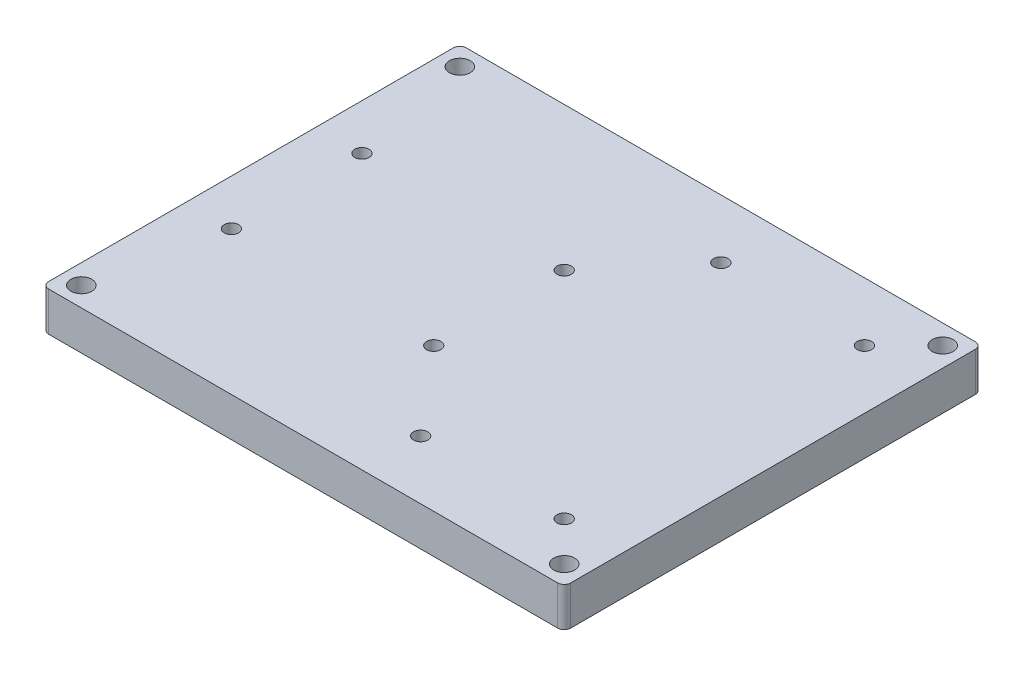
from build123d import *

# Parameters (mm, degrees)
ESQUISSE1_R        = 1.1
ESQUISSE1_R_2      = 1.6
BOSS_EXTRU_1_DEPTH = 6


with BuildPart() as part:
    # Esquisse1 → Boss.-Extru.1 (new body)
    with BuildSketch(Plane(origin=(0, 0, 0), x_dir=(1, 0, 0), z_dir=(0, 1, 0))):
        with BuildLine():
            Line((1, 0), (79, 0))
            ThreePointArc((79, 0), (79.707106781, 0.292893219), (80, 1))
            Line((80, 1), (80, 63))
            ThreePointArc((80, 63), (79.707106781, 63.707106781), (79, 64))
            Line((79, 64), (1, 64))
            ThreePointArc((1, 64), (0.292893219, 63.707106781), (0, 63))
            Line((0, 63), (0, 1))
            ThreePointArc((0, 1), (0.292893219, 0.292893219), (1, 0))
        make_face()
        with Locations(Location((71, 9, 0), (0, 0, 270))):
            Circle(ESQUISSE1_R, mode=Mode.SUBTRACT)
        with Locations(Location((49, 9, 0), (0, 0, 270))):
            Circle(ESQUISSE1_R, mode=Mode.SUBTRACT)
        with Locations(Location((38, 22, 0), (0, 0, 270))):
            Circle(ESQUISSE1_R, mode=Mode.SUBTRACT)
        with Locations(Location((7, 22, 0), (0, 0, 270))):
            Circle(ESQUISSE1_R, mode=Mode.SUBTRACT)
        with Locations(Location((77, 3, 0), (0, 0, 270))):
            Circle(ESQUISSE1_R_2, mode=Mode.SUBTRACT)
        with Locations(Location((3, 3, 0), (0, 0, 270))):
            Circle(ESQUISSE1_R_2, mode=Mode.SUBTRACT)
        with Locations(Location((77, 61, 0), (0, 0, 90))):
            Circle(ESQUISSE1_R_2, mode=Mode.SUBTRACT)
        with Locations(Location((71, 55, 0), (0, 0, 90))):
            Circle(ESQUISSE1_R, mode=Mode.SUBTRACT)
        with Locations(Location((49, 55, 0), (0, 0, 90))):
            Circle(ESQUISSE1_R, mode=Mode.SUBTRACT)
        with Locations(Location((38, 42, 0), (0, 0, 90))):
            Circle(ESQUISSE1_R, mode=Mode.SUBTRACT)
        with Locations(Location((7, 42, 0), (0, 0, 90))):
            Circle(ESQUISSE1_R, mode=Mode.SUBTRACT)
        with Locations(Location((3, 61, 0), (0, 0, 90))):
            Circle(ESQUISSE1_R_2, mode=Mode.SUBTRACT)
    extrude(amount=BOSS_EXTRU_1_DEPTH)


solid = part.part
